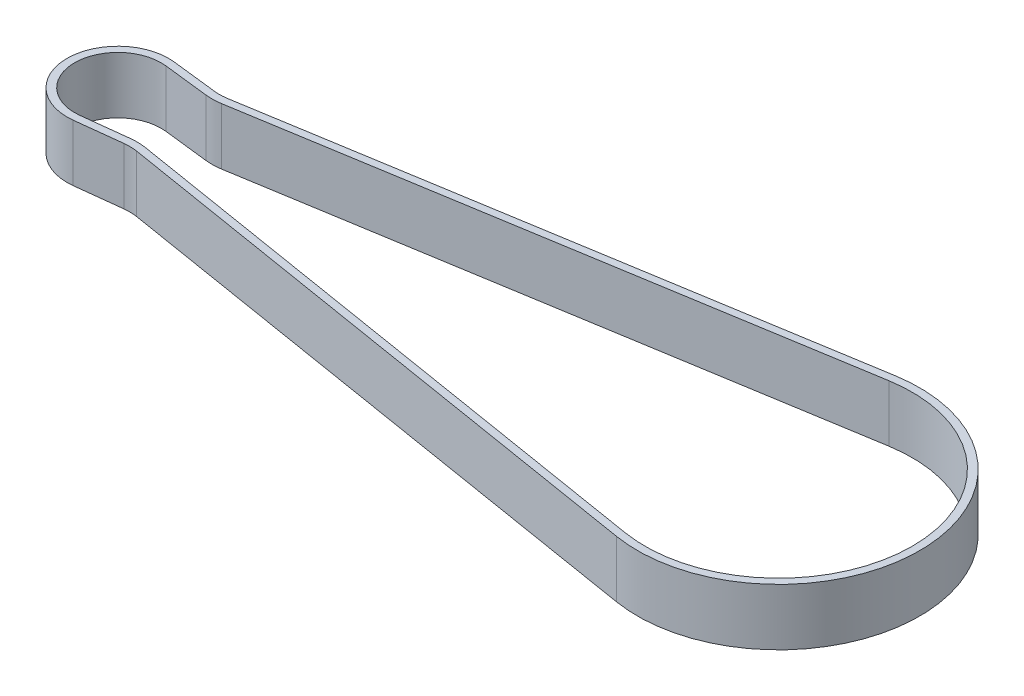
from build123d import *

# Parameters (mm, degrees)
LINEAR_AUSTRAGEN_D_NN1_DEPTH      = 3
LINEAR_AUSTRAGEN_D_NN1_DEPTH_BACK = 3


with BuildPart() as part:
    # Skizze1 → Linear-Austragen-D_nn1 (new, two sides: drawn at the far end of the back side and taken through both)
    with BuildSketch(Plane(origin=(0, 0, 0), x_dir=(1, 0, 0), z_dir=(0, 1, 0)).offset(-LINEAR_AUSTRAGEN_D_NN1_DEPTH_BACK)):
        with BuildLine():
            Line((5.425321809, 4.783135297), (0.617779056, 5.339379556))
            ThreePointArc((0.617779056, 5.339379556), (-5.375, 0), (0.617779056, -5.339379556))
            Line((0.617779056, -5.339379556), (5.425321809, -4.783135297))
            ThreePointArc((5.425321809, -4.783135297), (6.11685444, -4.751365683), (6.806147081, -4.815415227))
            Line((6.806147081, -4.815415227), (67.493650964, -14.729735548))
            ThreePointArc((67.493650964, -14.729735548), (84.825, 0), (67.493650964, 14.729735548))
            Line((67.493650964, 14.729735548), (6.806147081, 4.815415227))
            ThreePointArc((6.806147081, 4.815415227), (6.11685444, 4.751365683), (5.425321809, 4.783135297))
        make_face()
        with BuildLine():
            Line((5.333373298, 3.988436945), (0.525830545, 4.544681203))
            ThreePointArc((0.525830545, 4.544681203), (-4.575, 0), (0.525830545, -4.544681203))
            Line((0.525830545, -4.544681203), (5.333373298, -3.988436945))
            ThreePointArc((5.333373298, -3.988436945), (6.135551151, -3.951584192), (6.935130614, -4.025881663))
            Line((6.935130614, -4.025881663), (67.622634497, -13.940201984))
            ThreePointArc((67.622634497, -13.940201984), (84.025, 0), (67.622634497, 13.940201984))
            Line((67.622634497, 13.940201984), (6.935130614, 4.025881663))
            ThreePointArc((6.935130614, 4.025881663), (6.135551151, 3.951584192), (5.333373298, 3.988436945))
        make_face(mode=Mode.SUBTRACT)
    extrude(amount=LINEAR_AUSTRAGEN_D_NN1_DEPTH + LINEAR_AUSTRAGEN_D_NN1_DEPTH_BACK)


solid = part.part
